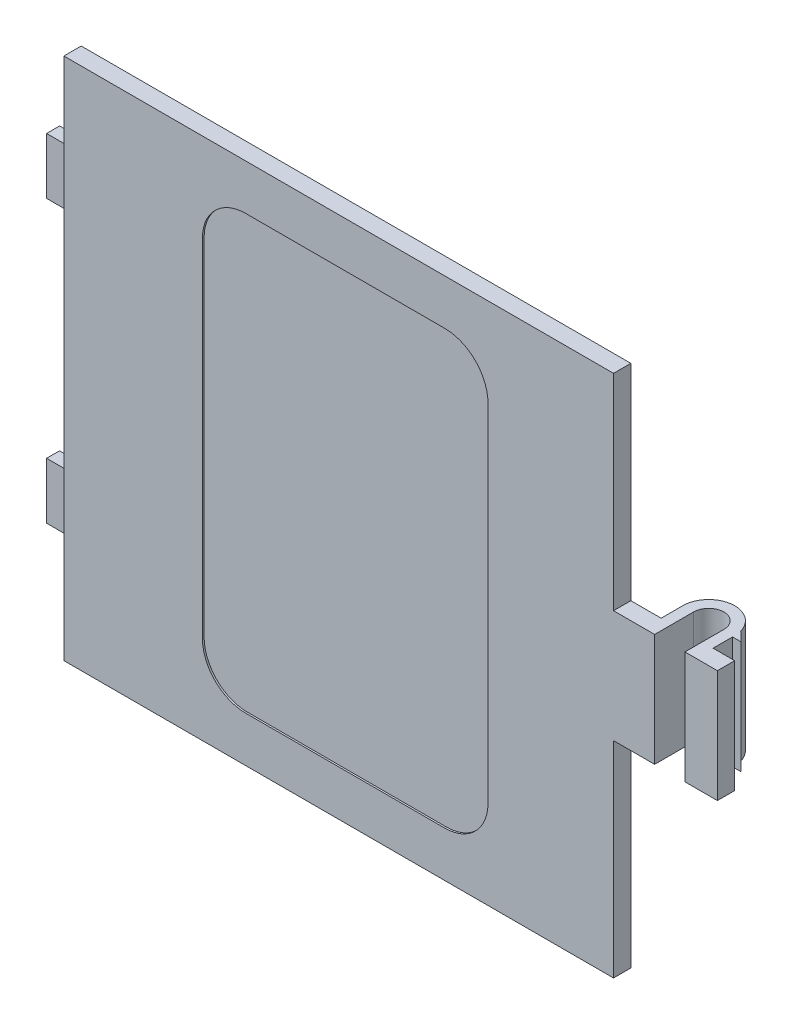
from build123d import *

# Parameters (mm, degrees)
ESQUISSE1_W             = 63.5
ESQUISSE1_H             = 60.5
BASE_EXTRUSION_DEPTH    = 2
BOSS_EXTRU_1_DEPTH      = 6.5
BOSS_EXTRU_1_DEPTH_BACK = 6.5
ESQUISSE3_W             = 6
ESQUISSE3_H             = 1.5
BOSS_EXTRU_2_DEPTH      = 6.5
ENL_V_MAT_EXTRU_1_DEPTH = 0.2


with BuildPart() as part:
    # Esquisse1 → Base-Extrusion (new body)
    with BuildSketch(Plane.XY):
        with Locations((-10, 0)):
            Rectangle(ESQUISSE1_W, ESQUISSE1_H)
    extrude(amount=-BASE_EXTRUSION_DEPTH)

    # Esquisse2 → Boss.-Extru.1 (add, two sides: drawn at the far end of the back side and taken through both)
    with BuildSketch(Plane.XZ.offset(-BOSS_EXTRU_1_DEPTH_BACK)):
        with BuildLine():
            Line((21.75, -2), (21.75, 0))
            Line((21.75, 0), (26.5, 0))
            Line((26.5, 0), (26.5, -4.5))
            ThreePointArc((26.5, -4.5), (28.25, -6.25), (30, -4.5))
            Line((30, -4.5), (30, 0))
            Line((30, 0), (33.75, 0))
            Line((33.75, 0), (33.75, -2))
            Line((33.75, -2), (31.25, -2))
            Line((31.25, -2), (31.25, -4.25))
            Line((31.25, -4.25), (32.25, -4.25))
            Line((32.25, -4.25), (31.25, -5.25))
            Line((31.25, -5.25), (31.15473751, -5.25))
            ThreePointArc((31.15473751, -5.25), (27.871987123, -7.476089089), (25.25, -4.5))
            Line((25.25, -4.5), (25.25, -2))
            Line((25.25, -2), (21.75, -2))
        make_face()
    extrude(amount=BOSS_EXTRU_1_DEPTH + BOSS_EXTRU_1_DEPTH_BACK)

    # Esquisse3 → Boss.-Extru.2 (add)
    with BuildSketch(Plane(origin=(0, 13, 0), x_dir=(-1, 0, 0), z_dir=(0, 1, 0))):
        with Locations((42.75, -2.75)):
            Rectangle(ESQUISSE3_W, ESQUISSE3_H)
    boss_extru_2 = extrude(amount=BOSS_EXTRU_2_DEPTH)

    # Sym_trie1: Boss.-Extru.2 across plane
    add(boss_extru_2.mirror(Plane.ZX))

    # Esquisse4 → Enl_v. mat.-Extru.1 (cut)
    with BuildSketch(Plane.XY):
        with BuildLine():
            Line((-25.75, -20), (-25.75, 20))
            ThreePointArc((-25.75, 20), (-24.285533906, 23.535533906), (-20.75, 25))
            Line((-20.75, 25), (2.25, 25))
            ThreePointArc((2.25, 25), (5.785533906, 23.535533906), (7.25, 20))
            Line((7.25, 20), (7.25, -20))
            ThreePointArc((7.25, -20), (5.785533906, -23.535533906), (2.25, -25))
            Line((2.25, -25), (-20.75, -25))
            ThreePointArc((-20.75, -25), (-24.285533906, -23.535533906), (-25.75, -20))
        make_face()
    extrude(amount=-ENL_V_MAT_EXTRU_1_DEPTH, mode=Mode.SUBTRACT)


solid = part.part
